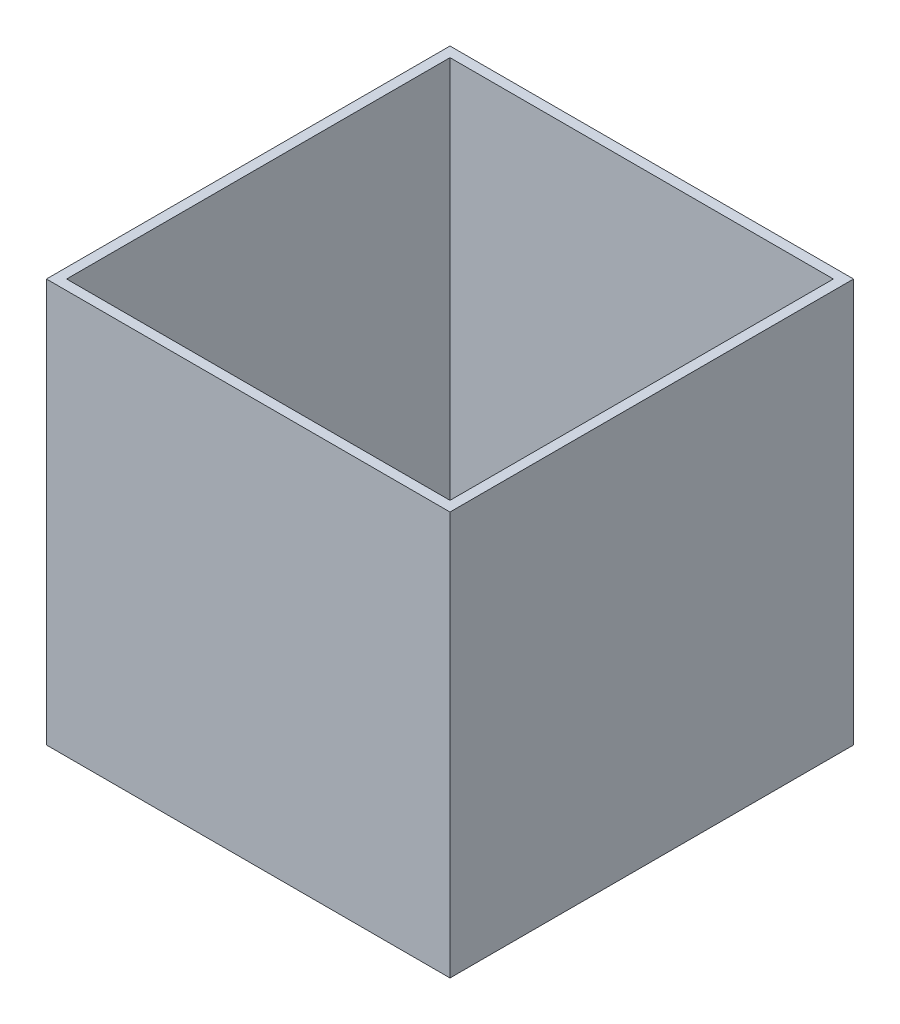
from build123d import *

# Parameters (mm, degrees)
SKETCH1_W           = 101.6
SKETCH1_H           = 101.6
BOSS_EXTRUDE1_DEPTH = 101.6
SHELL1_T            = -2.54


with BuildPart() as part:
    # Sketch1 → Boss-Extrude1 (new body)
    with BuildSketch(Plane(origin=(0, 0, 0), x_dir=(1, 0, 0), z_dir=(0, 1, 0))):
        with Locations((50.8, 50.8)):
            Rectangle(SKETCH1_W, SKETCH1_H)
    extrude(amount=BOSS_EXTRUDE1_DEPTH)

    # Shell1
    shell1_openings = [part.faces().sort_by_distance(p)[0] for p in [
        (50.8, 101.6, -50.8),
    ]]
    offset(amount=SHELL1_T, openings=shell1_openings, kind=Kind.INTERSECTION)


solid = part.part
